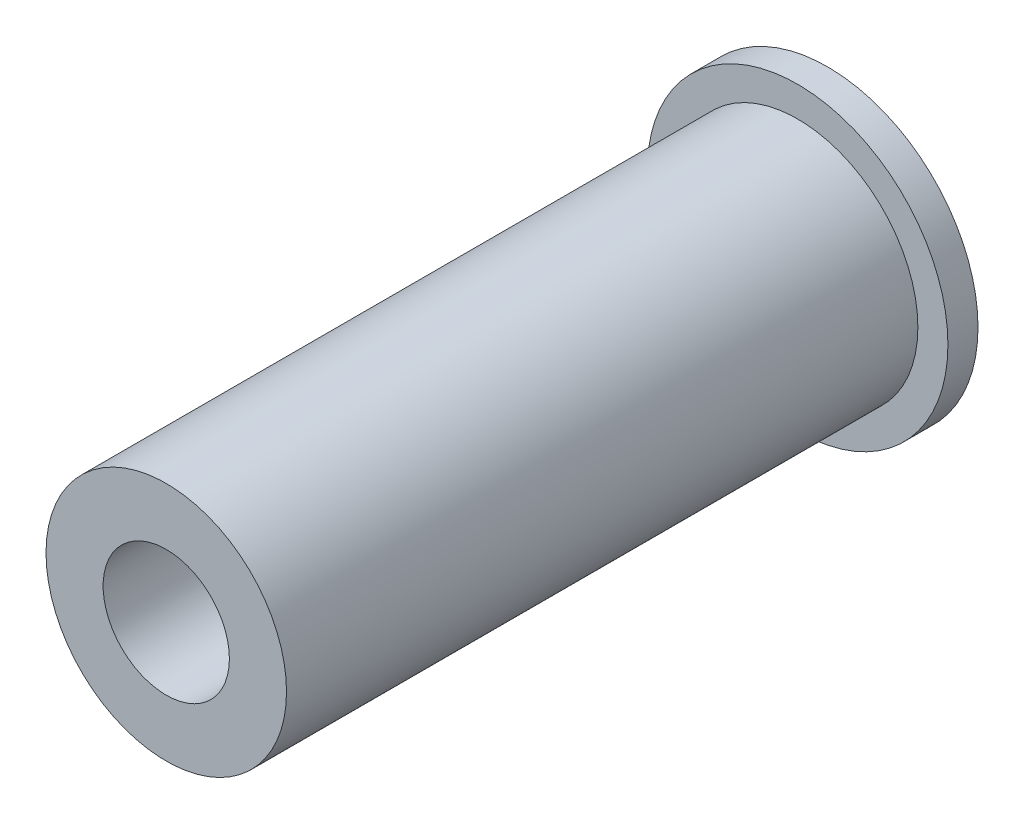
from build123d import *

# Parameters (mm, degrees)
ESQUISSE1_R         = 5
EXTRUSION1_DEPTH    = 22
ESQUISSE2_OUTSIDE_W = 17.23
ESQUISSE2_OUTSIDE_H = 17.23
ESQUISSE2_OUTSIDE_R = 4
EXTRUSION2_DEPTH    = 21
ESQUISSE3_R         = 2.1
EXTRUSION3_DEPTH    = 22


with BuildPart() as part:
    # Esquisse1 → Extrusion1 (new body)
    with BuildSketch(Plane.XY):
        Circle(ESQUISSE1_R)
    extrude(amount=EXTRUSION1_DEPTH)

    # Esquisse2 outside → Extrusion2 (cut)
    with BuildSketch(Plane.XY.offset(22)):
        Rectangle(ESQUISSE2_OUTSIDE_W, ESQUISSE2_OUTSIDE_H)
        Circle(ESQUISSE2_OUTSIDE_R, mode=Mode.SUBTRACT)
    extrude(amount=-EXTRUSION2_DEPTH, mode=Mode.SUBTRACT)

    # Esquisse3 → Extrusion3 (cut)
    with BuildSketch(Plane.XY.offset(22)):
        Circle(ESQUISSE3_R)
    extrude(amount=-EXTRUSION3_DEPTH, mode=Mode.SUBTRACT)


solid = part.part
